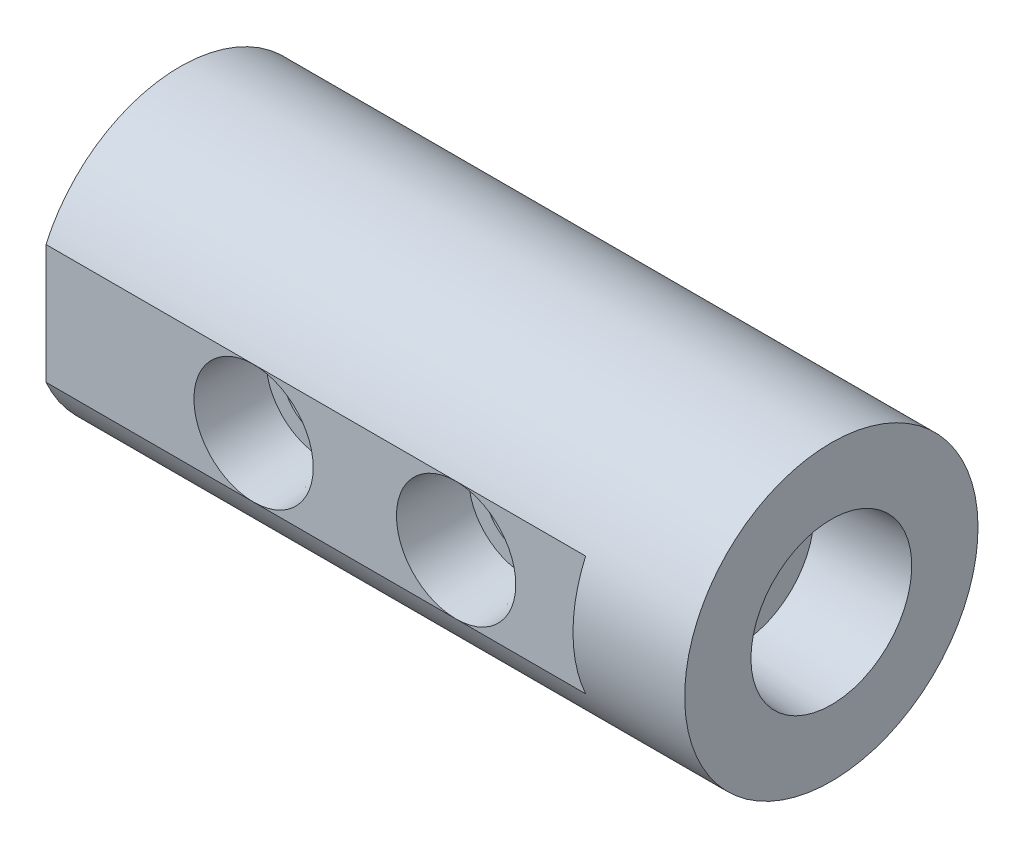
ISO-10303-21;
HEADER;
FILE_DESCRIPTION(('STEP AP214'),'2;1');
FILE_NAME('part.step','',(''),(''),'','','');
FILE_SCHEMA(('AUTOMOTIVE_DESIGN { 1 0 10303 214 1 1 1 1 }'));
ENDSEC;
DATA;
#1=APPLICATION_CONTEXT('core data for automotive mechanical design processes');
#2=APPLICATION_PROTOCOL_DEFINITION('international standard','automotive_design',2000,#1);
#3=PRODUCT_CONTEXT('',#1,'mechanical');
#4=PRODUCT('Part','Part','',(#3));
#5=PRODUCT_RELATED_PRODUCT_CATEGORY('part','',(#4));
#6=PRODUCT_DEFINITION_FORMATION('','',#4);
#7=PRODUCT_DEFINITION_CONTEXT('part definition',#1,'design');
#8=PRODUCT_DEFINITION('design','',#6,#7);
#9=PRODUCT_DEFINITION_SHAPE('','',#8);
#10=(LENGTH_UNIT() NAMED_UNIT(*) SI_UNIT(.MILLI.,.METRE.));
#11=(NAMED_UNIT(*) PLANE_ANGLE_UNIT() SI_UNIT($,.RADIAN.));
#12=(NAMED_UNIT(*) SI_UNIT($,.STERADIAN.) SOLID_ANGLE_UNIT());
#13=UNCERTAINTY_MEASURE_WITH_UNIT(LENGTH_MEASURE(1.E-05),#10,'distance_accuracy_value','');
#14=(GEOMETRIC_REPRESENTATION_CONTEXT(3) GLOBAL_UNCERTAINTY_ASSIGNED_CONTEXT((#13)) GLOBAL_UNIT_ASSIGNED_CONTEXT((#10,
#11,#12)) REPRESENTATION_CONTEXT('',''));
#15=CARTESIAN_POINT('',(0.,0.,0.));
#16=DIRECTION('',(0.,0.,1.));
#17=DIRECTION('',(1.,0.,0.));
#18=AXIS2_PLACEMENT_3D('',#15,#16,#17);
#19=CARTESIAN_POINT('',(34.9758,0.,25.019));
#20=DIRECTION('',(0.,0.,1.));
#21=DIRECTION('',(1.,0.,0.));
#22=AXIS2_PLACEMENT_3D('',#19,#20,#21);
#23=CONICAL_SURFACE('',#22,5.1435,0.0523598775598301);
#24=CARTESIAN_POINT('',(34.9758,0.,23.938041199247));
#25=DIRECTION('',(0.,0.,-1.));
#26=DIRECTION('',(-1.,0.,0.));
#27=AXIS2_PLACEMENT_3D('',#24,#25,#26);
#28=CIRCLE('',#27,5.08684934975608);
#29=CARTESIAN_POINT('',(34.9758,5.08684934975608,23.938041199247));
#30=VERTEX_POINT('',#29);
#31=CARTESIAN_POINT('',(34.9758,-5.08684934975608,23.938041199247));
#32=VERTEX_POINT('',#31);
#33=EDGE_CURVE('E24',#30,#32,#28,.T.);
#34=ORIENTED_EDGE('',*,*,#33,.F.);
#35=EDGE_CURVE('E19',#32,#30,#28,.T.);
#36=ORIENTED_EDGE('',*,*,#35,.F.);
#37=EDGE_LOOP('',(#34,#36));
#38=FACE_BOUND('',#37,.T.);
#39=CARTESIAN_POINT('',(34.9758,0.,18.0848));
#40=DIRECTION('',(0.,0.,-1.));
#41=DIRECTION('',(-1.,0.,0.));
#42=AXIS2_PLACEMENT_3D('',#39,#40,#41);
#43=CIRCLE('',#42,4.78009397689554);
#44=CARTESIAN_POINT('',(30.2683936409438,0.830435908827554,18.0848));
#45=VERTEX_POINT('',#44);
#46=CARTESIAN_POINT('',(30.2683936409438,-0.830435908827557,18.0848));
#47=VERTEX_POINT('',#46);
#48=EDGE_CURVE('E142',#45,#47,#43,.T.);
#49=ORIENTED_EDGE('',*,*,#48,.T.);
#50=CARTESIAN_POINT('',(30.2686411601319,-0.831777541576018,18.0846));
#51=CARTESIAN_POINT('',(30.2502611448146,-0.732341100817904,18.0994554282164));
#52=CARTESIAN_POINT('',(30.2351371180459,-0.631900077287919,18.1117018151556));
#53=CARTESIAN_POINT('',(30.2115526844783,-0.42968409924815,18.1308187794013));
#54=CARTESIAN_POINT('',(30.2030955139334,-0.327908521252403,18.1376867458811));
#55=CARTESIAN_POINT('',(30.1931122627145,-0.125774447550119,18.1457950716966));
#56=CARTESIAN_POINT('',(30.1914550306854,-0.0254267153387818,18.1471419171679));
#57=CARTESIAN_POINT('',(30.1947320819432,0.175036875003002,18.1444794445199));
#58=CARTESIAN_POINT('',(30.1996625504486,0.27515283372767,18.1404732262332));
#59=CARTESIAN_POINT('',(30.2141361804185,0.451419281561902,18.1287268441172));
#60=CARTESIAN_POINT('',(30.2223484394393,0.527756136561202,18.1220648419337));
#61=CARTESIAN_POINT('',(30.2426122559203,0.680180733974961,18.1056489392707));
#62=CARTESIAN_POINT('',(30.2546924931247,0.756262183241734,18.0958719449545));
#63=CARTESIAN_POINT('',(30.2686411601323,0.831777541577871,18.0845999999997));
#64=B_SPLINE_CURVE_WITH_KNOTS('',3,(#50,#51,#52,#53,#54,#55,#56,#57,#58,#59,#60,#61,#62,#63),
.UNSPECIFIED.,.F.,.F.,(4,2,2,2,2,2,4),(0.,0.306549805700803,0.61324832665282,0.91400288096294,
1.21458335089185,1.44563048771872,1.67843205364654),.UNSPECIFIED.);
#65=EDGE_CURVE('E31',#47,#45,#64,.T.);
#66=ORIENTED_EDGE('',*,*,#65,.T.);
#67=EDGE_LOOP('',(#49,#66));
#68=FACE_BOUND('',#67,.T.);
#69=ADVANCED_FACE('F15',(#38,#68),#23,.F.);
#70=CARTESIAN_POINT('',(39.7558939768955,0.,18.0848));
#71=DIRECTION('',(0.,0.,1.));
#72=DIRECTION('',(1.,0.,0.));
#73=AXIS2_PLACEMENT_3D('',#70,#71,#72);
#74=PLANE('',#73);
#75=ORIENTED_EDGE('',*,*,#48,.F.);
#76=DIRECTION('',(-1.,0.,0.));
#77=VECTOR('',#76,1.);
#78=CARTESIAN_POINT('',(23.6347,0.830435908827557,18.0848));
#79=LINE('',#78,#77);
#80=CARTESIAN_POINT('',(31.5595,0.830435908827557,18.0848));
#81=VERTEX_POINT('',#80);
#82=EDGE_CURVE('E134',#45,#81,#79,.F.);
#83=ORIENTED_EDGE('',*,*,#82,.T.);
#84=DIRECTION('',(0.,-1.,0.));
#85=VECTOR('',#84,1.);
#86=CARTESIAN_POINT('',(31.5595,0.,18.0848));
#87=LINE('',#86,#85);
#88=CARTESIAN_POINT('',(31.5595,0.,18.0848));
#89=VERTEX_POINT('',#88);
#90=EDGE_CURVE('E122',#81,#89,#87,.T.);
#91=ORIENTED_EDGE('',*,*,#90,.T.);
#92=CARTESIAN_POINT('',(34.9758,0.,18.0848));
#93=DIRECTION('',(0.,0.,-1.));
#94=DIRECTION('',(-1.,0.,0.));
#95=AXIS2_PLACEMENT_3D('',#92,#93,#94);
#96=CIRCLE('',#95,3.4163);
#97=EDGE_CURVE('E288',#89,#89,#96,.T.);
#98=ORIENTED_EDGE('',*,*,#97,.T.);
#99=CARTESIAN_POINT('',(31.5595,-0.830435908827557,18.0848));
#100=VERTEX_POINT('',#99);
#101=EDGE_CURVE('E127',#89,#100,#87,.T.);
#102=ORIENTED_EDGE('',*,*,#101,.T.);
#103=DIRECTION('',(-1.,0.,0.));
#104=VECTOR('',#103,1.);
#105=CARTESIAN_POINT('',(23.6347,-0.830435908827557,18.0848));
#106=LINE('',#105,#104);
#107=EDGE_CURVE('E135',#100,#47,#106,.T.);
#108=ORIENTED_EDGE('',*,*,#107,.T.);
#109=EDGE_LOOP('',(#75,#83,#91,#98,#102,#108));
#110=FACE_BOUND('',#109,.T.);
#111=ADVANCED_FACE('F140',(#110),#74,.T.);
#112=CARTESIAN_POINT('',(17.7038,0.,18.0848));
#113=DIRECTION('',(0.,0.,-1.));
#114=DIRECTION('',(-1.,0.,0.));
#115=AXIS2_PLACEMENT_3D('',#112,#113,#114);
#116=CYLINDRICAL_SURFACE('',#115,3.4163);
#117=CARTESIAN_POINT('',(17.7038,0.,18.0848));
#118=DIRECTION('',(0.,0.,-1.));
#119=DIRECTION('',(-1.,0.,0.));
#120=AXIS2_PLACEMENT_3D('',#117,#118,#119);
#121=CIRCLE('',#120,3.4163);
#122=CARTESIAN_POINT('',(14.2875,0.,18.0848));
#123=VERTEX_POINT('',#122);
#124=EDGE_CURVE('E291',#123,#123,#121,.T.);
#125=ORIENTED_EDGE('',*,*,#124,.F.);
#126=EDGE_LOOP('',(#125));
#127=FACE_BOUND('',#126,.T.);
#128=CARTESIAN_POINT('',(17.7038,0.,6.36660172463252));
#129=DIRECTION('',(0.,0.,-1.));
#130=DIRECTION('',(-1.,0.,0.));
#131=AXIS2_PLACEMENT_3D('',#128,#129,#130);
#132=CIRCLE('',#131,3.4163);
#133=CARTESIAN_POINT('',(14.2875,0.,6.36660172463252));
#134=VERTEX_POINT('',#133);
#135=EDGE_CURVE('E287',#134,#134,#132,.T.);
#136=ORIENTED_EDGE('',*,*,#135,.T.);
#137=EDGE_LOOP('',(#136));
#138=FACE_BOUND('',#137,.T.);
#139=CARTESIAN_POINT('',(21.1201,0.,15.4305));
#140=CARTESIAN_POINT('',(21.120090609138,-0.13763012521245,15.4304904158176));
#141=CARTESIAN_POINT('',(21.1117070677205,-0.275342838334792,15.4206974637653));
#142=CARTESIAN_POINT('',(21.0789248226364,-0.546180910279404,15.3822512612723));
#143=CARTESIAN_POINT('',(21.0545090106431,-0.679301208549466,15.3535778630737));
#144=CARTESIAN_POINT('',(20.9919180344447,-0.936371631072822,15.2795619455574));
#145=CARTESIAN_POINT('',(20.9538286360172,-1.06037323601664,15.2343232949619));
#146=CARTESIAN_POINT('',(20.8665053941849,-1.29786022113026,15.1295526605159));
#147=CARTESIAN_POINT('',(20.8172681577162,-1.41134238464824,15.070016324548));
#148=CARTESIAN_POINT('',(20.6901091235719,-1.66748912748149,14.9140660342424));
#149=CARTESIAN_POINT('',(20.6083827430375,-1.80495022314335,14.8122219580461));
#150=CARTESIAN_POINT('',(20.4354382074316,-2.05735949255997,14.589873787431));
#151=CARTESIAN_POINT('',(20.3441947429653,-2.17224516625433,14.4693194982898));
#152=CARTESIAN_POINT('',(20.2045919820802,-2.32855611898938,14.2750435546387));
#153=CARTESIAN_POINT('',(20.1571082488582,-2.37840870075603,14.2072902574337));
#154=CARTESIAN_POINT('',(20.0625230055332,-2.47223846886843,14.0675024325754));
#155=CARTESIAN_POINT('',(20.015421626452,-2.51621371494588,13.995466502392));
#156=CARTESIAN_POINT('',(19.9230083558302,-2.59808022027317,13.8471768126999));
#157=CARTESIAN_POINT('',(19.8776928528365,-2.63598428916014,13.7709324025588));
#158=CARTESIAN_POINT('',(19.7904669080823,-2.70555605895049,13.6138466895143));
#159=CARTESIAN_POINT('',(19.748553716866,-2.73722882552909,13.5330091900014));
#160=CARTESIAN_POINT('',(19.668091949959,-2.79558088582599,13.3613595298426));
#161=CARTESIAN_POINT('',(19.6298901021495,-2.8218528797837,13.2702401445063));
#162=CARTESIAN_POINT('',(19.5637571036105,-2.86587683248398,13.0824370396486));
#163=CARTESIAN_POINT('',(19.5358044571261,-2.88364664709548,12.9857654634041));
#164=CARTESIAN_POINT('',(19.4943231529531,-2.90960094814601,12.7863926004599));
#165=CARTESIAN_POINT('',(19.4810131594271,-2.91764029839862,12.683623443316));
#166=CARTESIAN_POINT('',(19.4727884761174,-2.92264023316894,12.4771064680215));
#167=CARTESIAN_POINT('',(19.4778564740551,-2.91961124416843,12.3733596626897));
#168=CARTESIAN_POINT('',(19.5029412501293,-2.90419341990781,12.1846802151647));
#169=CARTESIAN_POINT('',(19.5205797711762,-2.8932903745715,12.0992763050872));
#170=CARTESIAN_POINT('',(19.5654359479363,-2.86463291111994,11.9321592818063));
#171=CARTESIAN_POINT('',(19.5926699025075,-2.84686683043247,11.8504527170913));
#172=CARTESIAN_POINT('',(19.6512793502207,-2.80705729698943,11.6981209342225));
#173=CARTESIAN_POINT('',(19.6821021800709,-2.78550899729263,11.6271453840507));
#174=CARTESIAN_POINT('',(19.7476585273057,-2.73777318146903,11.4886158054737));
#175=CARTESIAN_POINT('',(19.7823950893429,-2.71158204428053,11.4210645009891));
#176=CARTESIAN_POINT('',(19.8904787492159,-2.62638732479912,11.2230068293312));
#177=CARTESIAN_POINT('',(19.9675929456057,-2.56083025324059,11.097346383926));
#178=CARTESIAN_POINT('',(20.1304457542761,-2.40749854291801,10.8484151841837));
#179=CARTESIAN_POINT('',(20.2163843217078,-2.3183775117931,10.7261181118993));
#180=CARTESIAN_POINT('',(20.384985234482,-2.1211247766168,10.4955428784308));
#181=CARTESIAN_POINT('',(20.4676513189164,-2.0130155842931,10.3872483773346));
#182=CARTESIAN_POINT('',(20.6198388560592,-1.7847920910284,10.1926400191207));
#183=CARTESIAN_POINT('',(20.6898552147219,-1.66581804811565,10.1053863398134));
#184=CARTESIAN_POINT('',(20.8181703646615,-1.41139345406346,9.94775688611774));
#185=CARTESIAN_POINT('',(20.8764804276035,-1.27595895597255,9.87736486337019));
#186=CARTESIAN_POINT('',(20.9681111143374,-1.01538344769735,9.767675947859));
#187=CARTESIAN_POINT('',(21.0040130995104,-0.892540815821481,9.72510166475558));
#188=CARTESIAN_POINT('',(21.0622633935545,-0.639271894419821,9.65630009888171));
#189=CARTESIAN_POINT('',(21.084621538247,-0.5088511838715,9.63006095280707));
#190=CARTESIAN_POINT('',(21.1140505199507,-0.243321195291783,9.59556343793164));
#191=CARTESIAN_POINT('',(21.1210540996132,-0.108193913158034,9.587384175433));
#192=CARTESIAN_POINT('',(21.1189358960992,0.16176355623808,9.58986143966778));
#193=CARTESIAN_POINT('',(21.1098143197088,0.296593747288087,9.6005177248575));
#194=CARTESIAN_POINT('',(21.0774538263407,0.552290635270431,9.63847860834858));
#195=CARTESIAN_POINT('',(21.0552444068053,0.673475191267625,9.66456962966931));
#196=CARTESIAN_POINT('',(20.9991651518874,0.909037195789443,9.73085334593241));
#197=CARTESIAN_POINT('',(20.9652935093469,1.02341358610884,9.77104822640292));
#198=CARTESIAN_POINT('',(20.8846056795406,1.25283364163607,9.86763898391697));
#199=CARTESIAN_POINT('',(20.8369374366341,1.36711677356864,9.92511696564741));
#200=CARTESIAN_POINT('',(20.7329148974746,1.58433524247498,10.0522667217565));
#201=CARTESIAN_POINT('',(20.676553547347,1.68726124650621,10.1219484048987));
#202=CARTESIAN_POINT('',(20.5277835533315,1.93012400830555,10.3093186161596));
#203=CARTESIAN_POINT('',(20.4314806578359,2.06270819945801,10.433548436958));
#204=CARTESIAN_POINT('',(20.2830534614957,2.24156498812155,10.6344802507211));
#205=CARTESIAN_POINT('',(20.2328350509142,2.29791871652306,10.7040072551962));
#206=CARTESIAN_POINT('',(20.1322492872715,2.4039715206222,10.8478336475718));
#207=CARTESIAN_POINT('',(20.0818819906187,2.45367285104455,10.9221314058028));
#208=CARTESIAN_POINT('',(19.9569856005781,2.56996413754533,11.1145643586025));
#209=CARTESIAN_POINT('',(19.8831669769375,2.63232397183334,11.2358110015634));
#210=CARTESIAN_POINT('',(19.7796017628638,2.71368799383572,11.4265039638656));
#211=CARTESIAN_POINT('',(19.7463005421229,2.73876295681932,11.491476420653));
#212=CARTESIAN_POINT('',(19.6833147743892,2.78462509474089,11.6245920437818));
#213=CARTESIAN_POINT('',(19.6536281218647,2.80541477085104,11.6927333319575));
#214=CARTESIAN_POINT('',(19.5926033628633,2.84696514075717,11.849821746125));
#215=CARTESIAN_POINT('',(19.5627129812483,2.86641514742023,11.9397062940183));
#216=CARTESIAN_POINT('',(19.5148051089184,2.89692797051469,12.1238669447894));
#217=CARTESIAN_POINT('',(19.496757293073,2.90801222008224,12.2181311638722));
#218=CARTESIAN_POINT('',(19.47570452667,2.92089706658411,12.409997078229));
#219=CARTESIAN_POINT('',(19.4728457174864,2.92260747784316,12.5076221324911));
#220=CARTESIAN_POINT('',(19.4832312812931,2.9162908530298,12.7017205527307));
#221=CARTESIAN_POINT('',(19.496492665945,2.90825353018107,12.7981925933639));
#222=CARTESIAN_POINT('',(19.5404084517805,2.88075399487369,13.0061349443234));
#223=CARTESIAN_POINT('',(19.574045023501,2.85930518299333,13.1166786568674));
#224=CARTESIAN_POINT('',(19.6538871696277,2.80545293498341,13.3304249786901));
#225=CARTESIAN_POINT('',(19.7001371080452,2.77301073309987,13.4336000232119));
#226=CARTESIAN_POINT('',(19.7913813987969,2.70477474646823,13.6159549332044));
#227=CARTESIAN_POINT('',(19.8352862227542,2.67045479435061,13.6962576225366));
#228=CARTESIAN_POINT('',(19.9259203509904,2.5955239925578,13.8522544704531));
#229=CARTESIAN_POINT('',(19.9726513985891,2.55490923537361,13.927945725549));
#230=CARTESIAN_POINT('',(20.0673794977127,2.46754103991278,14.0750042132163));
#231=CARTESIAN_POINT('',(20.1153779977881,2.42078031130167,14.146366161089));
#232=CARTESIAN_POINT('',(20.2113659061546,2.32120724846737,14.2847472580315));
#233=CARTESIAN_POINT('',(20.2593553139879,2.26839466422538,14.3517662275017));
#234=CARTESIAN_POINT('',(20.3564206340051,2.15419924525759,14.4842537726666));
#235=CARTESIAN_POINT('',(20.4054489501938,2.09253851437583,14.5495184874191));
#236=CARTESIAN_POINT('',(20.501306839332,1.96254574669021,14.6748656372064));
#237=CARTESIAN_POINT('',(20.548135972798,1.89421238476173,14.7349470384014));
#238=CARTESIAN_POINT('',(20.638420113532,1.7510707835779,14.8492336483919));
#239=CARTESIAN_POINT('',(20.6818836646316,1.67628003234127,14.9034538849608));
#240=CARTESIAN_POINT('',(20.7644917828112,1.52022021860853,15.0054694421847));
#241=CARTESIAN_POINT('',(20.8036369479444,1.43895205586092,15.0532656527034));
#242=CARTESIAN_POINT('',(20.8899410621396,1.23911359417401,15.1578579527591));
#243=CARTESIAN_POINT('',(20.9347501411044,1.11781933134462,15.2114960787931));
#244=CARTESIAN_POINT('',(21.0112640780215,0.865501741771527,15.3025382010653));
#245=CARTESIAN_POINT('',(21.042991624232,0.734495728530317,15.3399703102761));
#246=CARTESIAN_POINT('',(21.084390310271,0.502566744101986,15.3886732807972));
#247=CARTESIAN_POINT('',(21.0977180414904,0.403193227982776,15.4042961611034));
#248=CARTESIAN_POINT('',(21.1155769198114,0.202561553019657,15.4252137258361));
#249=CARTESIAN_POINT('',(21.1201069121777,0.101303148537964,15.4305070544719));
#250=CARTESIAN_POINT('',(21.1201,0.,15.4305));
#251=B_SPLINE_CURVE_WITH_KNOTS('',3,(#139,#140,#141,#142,#143,#144,#145,#146,#147,#148,#149,
#150,#151,#152,#153,#154,#155,#156,#157,#158,#159,#160,#161,#162,#163,#164,#165,#166,#167,#168,
#169,#170,#171,#172,#173,#174,#175,#176,#177,#178,#179,#180,#181,#182,#183,#184,#185,#186,#187,
#188,#189,#190,#191,#192,#193,#194,#195,#196,#197,#198,#199,#200,#201,#202,#203,#204,#205,#206,
#207,#208,#209,#210,#211,#212,#213,#214,#215,#216,#217,#218,#219,#220,#221,#222,#223,#224,#225,
#226,#227,#228,#229,#230,#231,#232,#233,#234,#235,#236,#237,#238,#239,#240,#241,#242,#243,#244,
#245,#246,#247,#248,#249,#250),.UNSPECIFIED.,.T.,.F.,(4,2,2,2,2,2,2,2,2,2,2,2,2,2,2,2,2,2,2,2,2,
2,2,2,2,2,2,2,2,2,2,2,2,2,2,2,2,2,2,2,2,2,2,2,2,2,2,2,2,2,2,2,2,2,2,4),(0.,0.412458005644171,
0.825356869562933,1.23570987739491,1.6461879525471,2.21196913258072,2.77929526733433,
3.06886037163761,3.35852083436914,3.64756185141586,3.93636691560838,4.24229184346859,
4.54757143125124,4.85735046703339,5.16683776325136,5.42949040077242,5.69259134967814,
5.93321287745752,6.17402290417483,6.65647364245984,7.17705207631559,7.69701744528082,
8.18514797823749,8.67280622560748,9.07575731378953,9.47841541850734,9.88283378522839,
10.2872469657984,10.663440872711,11.0396931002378,11.4477435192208,11.8561268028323,
12.4694827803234,12.7771111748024,13.0846350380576,13.5482291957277,13.7796106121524,
14.010856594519,14.3000046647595,14.58840939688,14.8795840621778,15.1710662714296,
15.5216678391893,15.8735188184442,16.1663794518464,16.459422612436,16.7528165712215,
17.0462226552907,17.3527691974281,17.6593767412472,17.9651785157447,18.2709378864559,
18.6891835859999,19.1067008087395,19.4102521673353,19.713843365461),.UNSPECIFIED.);
#252=CARTESIAN_POINT('',(21.1201,0.,15.4305));
#253=VERTEX_POINT('',#252);
#254=EDGE_CURVE('E211',#253,#253,#251,.T.);
#255=ORIENTED_EDGE('',*,*,#254,.T.);
#256=EDGE_LOOP('',(#255));
#257=FACE_BOUND('',#256,.T.);
#258=ADVANCED_FACE('F220',(#127,#138,#257),#116,.F.);
#259=CARTESIAN_POINT('',(34.9758,0.,18.0848));
#260=DIRECTION('',(0.,0.,-1.));
#261=DIRECTION('',(-1.,0.,0.));
#262=AXIS2_PLACEMENT_3D('',#259,#260,#261);
#263=CYLINDRICAL_SURFACE('',#262,3.4163);
#264=CARTESIAN_POINT('',(31.5595,0.,16.4719));
#265=CARTESIAN_POINT('',(31.559497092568,0.0803063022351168,16.4719028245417));
#266=CARTESIAN_POINT('',(31.5623347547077,0.160589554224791,16.4694552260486));
#267=CARTESIAN_POINT('',(31.5736227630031,0.320492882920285,16.4597290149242));
#268=CARTESIAN_POINT('',(31.582074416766,0.400112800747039,16.4524492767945));
#269=CARTESIAN_POINT('',(31.604444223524,0.558060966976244,16.4332119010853));
#270=CARTESIAN_POINT('',(31.618366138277,0.636388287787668,16.4212510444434));
#271=CARTESIAN_POINT('',(31.6514223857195,0.79113340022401,16.3929164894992));
#272=CARTESIAN_POINT('',(31.6705590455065,0.867550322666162,16.3765408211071));
#273=CARTESIAN_POINT('',(31.7350557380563,1.09214125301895,16.3215099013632));
#274=CARTESIAN_POINT('',(31.7876769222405,1.23684061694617,16.2767990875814));
#275=CARTESIAN_POINT('',(31.9094782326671,1.51385792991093,16.1743010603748));
#276=CARTESIAN_POINT('',(31.978663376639,1.64617211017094,16.116509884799));
#277=CARTESIAN_POINT('',(32.1601360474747,1.94533174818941,15.966934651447));
#278=CARTESIAN_POINT('',(32.2787960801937,2.10608199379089,15.8705951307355));
#279=CARTESIAN_POINT('',(32.4727699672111,2.32714973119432,15.7177858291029));
#280=CARTESIAN_POINT('',(32.5402275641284,2.39760447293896,15.6653643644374));
#281=CARTESIAN_POINT('',(32.6801239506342,2.53186918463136,15.5586936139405));
#282=CARTESIAN_POINT('',(32.7525609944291,2.59568146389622,15.5044449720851));
#283=CARTESIAN_POINT('',(32.9037180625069,2.71794677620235,15.393994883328));
#284=CARTESIAN_POINT('',(32.982537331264,2.77626097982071,15.3377762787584));
#285=CARTESIAN_POINT('',(33.1450863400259,2.8860378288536,15.2256648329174));
#286=CARTESIAN_POINT('',(33.2288176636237,2.93749824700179,15.16977210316));
#287=CARTESIAN_POINT('',(33.401150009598,3.03336278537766,15.0599162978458));
#288=CARTESIAN_POINT('',(33.4897406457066,3.07778122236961,15.0059494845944));
#289=CARTESIAN_POINT('',(33.672250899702,3.159406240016,14.9018077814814));
#290=CARTESIAN_POINT('',(33.7661662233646,3.19661852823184,14.8516299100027));
#291=CARTESIAN_POINT('',(33.9645415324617,3.26496690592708,14.7554389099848));
#292=CARTESIAN_POINT('',(34.0692918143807,3.29572215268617,14.7097445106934));
#293=CARTESIAN_POINT('',(34.2854208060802,3.34764850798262,14.6299129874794));
#294=CARTESIAN_POINT('',(34.3967863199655,3.36883801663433,14.5957537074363));
#295=CARTESIAN_POINT('',(34.5687542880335,3.39247015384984,14.5569357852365));
#296=CARTESIAN_POINT('',(34.6274071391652,3.39900818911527,14.5460292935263));
#297=CARTESIAN_POINT('',(34.745662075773,3.40905503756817,14.5291672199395));
#298=CARTESIAN_POINT('',(34.8052635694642,3.4125656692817,14.5232086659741));
#299=CARTESIAN_POINT('',(34.9248168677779,3.41644244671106,14.5166249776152));
#300=CARTESIAN_POINT('',(34.9847683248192,3.41681130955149,14.5159952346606));
#301=CARTESIAN_POINT('',(35.1044098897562,3.4144034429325,14.5200882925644));
#302=CARTESIAN_POINT('',(35.1641000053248,3.4116268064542,14.524810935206));
#303=CARTESIAN_POINT('',(35.3230241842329,3.40007288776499,14.544281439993));
#304=CARTESIAN_POINT('',(35.4215104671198,3.3884971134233,14.5636658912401));
#305=CARTESIAN_POINT('',(35.6142426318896,3.35754135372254,14.6138699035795));
#306=CARTESIAN_POINT('',(35.708480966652,3.33814804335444,14.6447089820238));
#307=CARTESIAN_POINT('',(35.8835396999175,3.29461308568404,14.7112196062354));
#308=CARTESIAN_POINT('',(35.9647931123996,3.27108033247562,14.7461755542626));
#309=CARTESIAN_POINT('',(36.1234615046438,3.21884492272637,14.8207168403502));
#310=CARTESIAN_POINT('',(36.2008734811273,3.19013829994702,14.8603057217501));
#311=CARTESIAN_POINT('',(36.3522740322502,3.12780229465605,14.9426342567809));
#312=CARTESIAN_POINT('',(36.4262512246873,3.09415789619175,14.9853833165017));
#313=CARTESIAN_POINT('',(36.5707741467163,3.02219780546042,15.0727285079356));
#314=CARTESIAN_POINT('',(36.6413189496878,2.98388086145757,15.117325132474));
#315=CARTESIAN_POINT('',(36.8037008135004,2.88819350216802,15.2234848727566));
#316=CARTESIAN_POINT('',(36.894162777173,2.82890033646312,15.285428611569));
#317=CARTESIAN_POINT('',(37.0691883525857,2.70194730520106,15.4091488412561));
#318=CARTESIAN_POINT('',(37.1537497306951,2.63428429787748,15.4709252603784));
#319=CARTESIAN_POINT('',(37.3165890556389,2.49069595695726,15.5926617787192));
#320=CARTESIAN_POINT('',(37.3948795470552,2.41478787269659,15.6526253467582));
#321=CARTESIAN_POINT('',(37.544867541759,2.25456019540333,15.7694710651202));
#322=CARTESIAN_POINT('',(37.6165651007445,2.17024067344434,15.8263532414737));
#323=CARTESIAN_POINT('',(37.7844850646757,1.95172927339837,15.9612634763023));
#324=CARTESIAN_POINT('',(37.8765140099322,1.81264304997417,16.0367536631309));
#325=CARTESIAN_POINT('',(38.0413597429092,1.51722188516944,16.1735226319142));
#326=CARTESIAN_POINT('',(38.1142031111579,1.36091123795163,16.2348210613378));
#327=CARTESIAN_POINT('',(38.2272232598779,1.05885599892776,16.3305612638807));
#328=CARTESIAN_POINT('',(38.2707094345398,0.915214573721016,16.3676901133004));
#329=CARTESIAN_POINT('',(38.3387026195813,0.620350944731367,16.4259155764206));
#330=CARTESIAN_POINT('',(38.3632201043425,0.469132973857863,16.4470210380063));
#331=CARTESIAN_POINT('',(38.3916940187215,0.162800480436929,16.4715432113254));
#332=CARTESIAN_POINT('',(38.3955814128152,0.00767461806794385,16.4749005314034));
#333=CARTESIAN_POINT('',(38.3823197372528,-0.300992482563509,16.4634693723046));
#334=CARTESIAN_POINT('',(38.3651692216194,-0.454533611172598,16.4486796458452));
#335=CARTESIAN_POINT('',(38.3124756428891,-0.747466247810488,16.403436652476));
#336=CARTESIAN_POINT('',(38.2779408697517,-0.887177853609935,16.3738425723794));
#337=CARTESIAN_POINT('',(38.1929808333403,-1.15802807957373,16.3015004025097));
#338=CARTESIAN_POINT('',(38.1425509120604,-1.28916417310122,16.2587484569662));
#339=CARTESIAN_POINT('',(38.0074461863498,-1.58602906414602,16.1452381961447));
#340=CARTESIAN_POINT('',(37.9169737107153,-1.74737736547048,16.0699310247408));
#341=CARTESIAN_POINT('',(37.7154693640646,-2.04899529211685,15.9053618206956));
#342=CARTESIAN_POINT('',(37.6043874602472,-2.18921208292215,15.8160659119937));
#343=CARTESIAN_POINT('',(37.4100145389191,-2.39955591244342,15.6642960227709));
#344=CARTESIAN_POINT('',(37.3318289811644,-2.4763077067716,15.6042532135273));
#345=CARTESIAN_POINT('',(37.1692805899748,-2.62137661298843,15.4823714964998));
#346=CARTESIAN_POINT('',(37.0849185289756,-2.68969477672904,15.4205328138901));
#347=CARTESIAN_POINT('',(36.9102571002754,-2.81792892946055,15.2965840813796));
#348=CARTESIAN_POINT('',(36.8199586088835,-2.8778461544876,15.2344740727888));
#349=CARTESIAN_POINT('',(36.6333606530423,-2.9892131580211,15.1118207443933));
#350=CARTESIAN_POINT('',(36.5370647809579,-3.04066793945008,15.0512765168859));
#351=CARTESIAN_POINT('',(36.3243334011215,-3.1413812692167,14.9260320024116));
#352=CARTESIAN_POINT('',(36.2069480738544,-3.18936815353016,14.8619025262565));
#353=CARTESIAN_POINT('',(35.9630064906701,-3.2730869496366,14.7439405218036));
#354=CARTESIAN_POINT('',(35.8364692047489,-3.30884337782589,14.690087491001));
#355=CARTESIAN_POINT('',(35.6053725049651,-3.35933894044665,14.6111950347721));
#356=CARTESIAN_POINT('',(35.5028127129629,-3.37706123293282,14.5823433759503));
#357=CARTESIAN_POINT('',(35.2935797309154,-3.40311197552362,14.5393028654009));
#358=CARTESIAN_POINT('',(35.1869171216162,-3.41146310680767,14.5250786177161));
#359=CARTESIAN_POINT('',(34.9716747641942,-3.41800080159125,14.5139808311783));
#360=CARTESIAN_POINT('',(34.8630873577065,-3.41612615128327,14.517211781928));
#361=CARTESIAN_POINT('',(34.6483502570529,-3.40228128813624,14.5405720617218));
#362=CARTESIAN_POINT('',(34.5422052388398,-3.39029313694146,14.5607314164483));
#363=CARTESIAN_POINT('',(34.2999449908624,-3.35172562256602,14.6233288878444));
#364=CARTESIAN_POINT('',(34.165804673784,-3.32158736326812,14.6709896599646));
#365=CARTESIAN_POINT('',(33.9072742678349,-3.24770348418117,14.7804896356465));
#366=CARTESIAN_POINT('',(33.7829235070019,-3.20390616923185,14.8423824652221));
#367=CARTESIAN_POINT('',(33.5637618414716,-3.11268634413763,14.9623563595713));
#368=CARTESIAN_POINT('',(33.4675197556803,-3.06714128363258,15.0193009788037));
#369=CARTESIAN_POINT('',(33.2808069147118,-2.9680441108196,15.135747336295));
#370=CARTESIAN_POINT('',(33.1903397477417,-2.91448708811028,15.1952506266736));
#371=CARTESIAN_POINT('',(33.0149860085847,-2.79951781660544,15.3148879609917));
#372=CARTESIAN_POINT('',(32.9300994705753,-2.73810551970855,15.3750220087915));
#373=CARTESIAN_POINT('',(32.7659937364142,-2.60746130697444,15.4943942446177));
#374=CARTESIAN_POINT('',(32.6867725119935,-2.5382322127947,15.5536327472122));
#375=CARTESIAN_POINT('',(32.4791534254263,-2.33901966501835,15.7119184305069));
#376=CARTESIAN_POINT('',(32.3564779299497,-2.20121820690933,15.8088756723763));
#377=CARTESIAN_POINT('',(32.1319737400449,-1.90224783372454,15.989801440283));
#378=CARTESIAN_POINT('',(32.0301070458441,-1.74112244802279,16.073793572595));
#379=CARTESIAN_POINT('',(31.8711699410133,-1.4337349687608,16.2063580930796));
#380=CARTESIAN_POINT('',(31.8091788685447,-1.29164271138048,16.2586640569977));
#381=CARTESIAN_POINT('',(31.7041904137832,-0.996065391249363,16.3477496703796));
#382=CARTESIAN_POINT('',(31.6611619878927,-0.842599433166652,16.3845546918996));
#383=CARTESIAN_POINT('',(31.6060948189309,-0.573772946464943,16.4317812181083));
#384=CARTESIAN_POINT('',(31.5886865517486,-0.460278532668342,16.4467596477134));
#385=CARTESIAN_POINT('',(31.5653906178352,-0.231173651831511,16.4668175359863));
#386=CARTESIAN_POINT('',(31.559504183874,-0.115562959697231,16.4718959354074));
#387=CARTESIAN_POINT('',(31.5595,0.,16.4719));
#388=B_SPLINE_CURVE_WITH_KNOTS('',3,(#264,#265,#266,#267,#268,#269,#270,#271,#272,#273,#274,
#275,#276,#277,#278,#279,#280,#281,#282,#283,#284,#285,#286,#287,#288,#289,#290,#291,#292,#293,
#294,#295,#296,#297,#298,#299,#300,#301,#302,#303,#304,#305,#306,#307,#308,#309,#310,#311,#312,
#313,#314,#315,#316,#317,#318,#319,#320,#321,#322,#323,#324,#325,#326,#327,#328,#329,#330,#331,
#332,#333,#334,#335,#336,#337,#338,#339,#340,#341,#342,#343,#344,#345,#346,#347,#348,#349,#350,
#351,#352,#353,#354,#355,#356,#357,#358,#359,#360,#361,#362,#363,#364,#365,#366,#367,#368,#369,
#370,#371,#372,#373,#374,#375,#376,#377,#378,#379,#380,#381,#382,#383,#384,#385,#386,#387),
.UNSPECIFIED.,.T.,.F.,(4,2,2,2,2,2,2,2,2,2,2,2,2,2,2,2,2,2,2,2,2,2,2,2,2,2,2,2,2,2,2,2,2,2,2,2,
2,2,2,2,2,2,2,2,2,2,2,2,2,2,2,2,2,2,2,2,2,2,2,2,2,4),(0.,0.240792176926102,0.481640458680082,
0.722654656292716,0.96377658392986,1.44244573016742,1.92126006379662,2.58282558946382,
2.91480342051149,3.24666544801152,3.5854198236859,3.92428401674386,4.26245019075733,
4.60034741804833,4.9545842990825,5.30813685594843,5.48793742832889,5.66762992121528,
5.84716699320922,6.02669875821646,6.32847127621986,6.63076035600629,6.9049522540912,
7.17935524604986,7.45461069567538,7.72994004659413,8.10342515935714,8.47705089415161,
8.84990950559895,9.22276496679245,9.76983274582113,10.3161385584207,10.7779757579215,
11.239557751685,11.7026833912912,12.1658408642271,12.6047878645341,13.0438636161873,
13.6398152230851,14.2372329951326,14.6116324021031,14.9859850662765,15.3602825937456,
15.734358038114,16.1597970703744,16.5843782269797,16.907216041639,17.2292707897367,
17.5532555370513,17.8778161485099,18.3119103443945,18.7476678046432,19.1094542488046,
19.4714633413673,19.8334746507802,20.1953556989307,20.8181323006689,21.4397612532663,
21.928687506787,22.4168103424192,22.7632797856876,23.1097862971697),.UNSPECIFIED.);
#389=CARTESIAN_POINT('',(31.5595,0.,16.4719));
#390=VERTEX_POINT('',#389);
#391=EDGE_CURVE('E183',#390,#390,#388,.T.);
#392=ORIENTED_EDGE('',*,*,#391,.T.);
#393=EDGE_LOOP('',(#392));
#394=FACE_BOUND('',#393,.T.);
#395=ORIENTED_EDGE('',*,*,#97,.F.);
#396=EDGE_LOOP('',(#395));
#397=FACE_BOUND('',#396,.T.);
#398=ADVANCED_FACE('F188',(#394,#397),#263,.F.);
#399=CARTESIAN_POINT('',(47.625,0.,6.06682116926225));
#400=DIRECTION('',(1.,0.,0.));
#401=DIRECTION('',(0.,0.,-1.));
#402=AXIS2_PLACEMENT_3D('',#399,#400,#401);
#403=PLANE('',#402);
#404=CARTESIAN_POINT('',(47.625,0.,12.5095));
#405=DIRECTION('',(-1.,0.,0.));
#406=DIRECTION('',(0.,0.,1.));
#407=AXIS2_PLACEMENT_3D('',#404,#405,#406);
#408=CIRCLE('',#407,6.44267883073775);
#409=CARTESIAN_POINT('',(47.625,0.,18.9521788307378));
#410=VERTEX_POINT('',#409);
#411=EDGE_CURVE('E436',#410,#410,#408,.T.);
#412=ORIENTED_EDGE('',*,*,#411,.F.);
#413=EDGE_LOOP('',(#412));
#414=FACE_BOUND('',#413,.T.);
#415=CARTESIAN_POINT('',(47.625,0.,12.5095));
#416=DIRECTION('',(1.,0.,0.));
#417=DIRECTION('',(0.,0.,-1.));
#418=AXIS2_PLACEMENT_3D('',#415,#416,#417);
#419=CIRCLE('',#418,3.9624);
#420=CARTESIAN_POINT('',(47.625,0.,8.5471));
#421=VERTEX_POINT('',#420);
#422=EDGE_CURVE('E218',#421,#421,#419,.F.);
#423=ORIENTED_EDGE('',*,*,#422,.T.);
#424=EDGE_LOOP('',(#423));
#425=FACE_BOUND('',#424,.T.);
#426=ADVANCED_FACE('F208',(#414,#425),#403,.T.);
#427=CARTESIAN_POINT('',(55.5498,0.,12.5095));
#428=DIRECTION('',(-1.,0.,0.));
#429=DIRECTION('',(0.,-1.,0.));
#430=AXIS2_PLACEMENT_3D('',#427,#428,#429);
#431=PLANE('',#430);
#432=CARTESIAN_POINT('',(55.5498,0.,12.5095));
#433=DIRECTION('',(-1.,0.,0.));
#434=DIRECTION('',(0.,1.,0.));
#435=AXIS2_PLACEMENT_3D('',#432,#433,#434);
#436=CIRCLE('',#435,12.5095);
#437=CARTESIAN_POINT('',(55.5498,12.5095,12.5095));
#438=VERTEX_POINT('',#437);
#439=EDGE_CURVE('E356',#438,#438,#436,.T.);
#440=ORIENTED_EDGE('',*,*,#439,.F.);
#441=EDGE_LOOP('',(#440));
#442=FACE_BOUND('',#441,.T.);
#443=CARTESIAN_POINT('',(55.5498,0.,12.5095));
#444=DIRECTION('',(-1.,0.,0.));
#445=DIRECTION('',(0.,0.,1.));
#446=AXIS2_PLACEMENT_3D('',#443,#444,#445);
#447=CIRCLE('',#446,6.858);
#448=CARTESIAN_POINT('',(55.5498,0.,19.3675));
#449=VERTEX_POINT('',#448);
#450=EDGE_CURVE('E434',#449,#449,#447,.T.);
#451=ORIENTED_EDGE('',*,*,#450,.T.);
#452=EDGE_LOOP('',(#451));
#453=FACE_BOUND('',#452,.T.);
#454=ADVANCED_FACE('F266',(#442,#453),#431,.F.);
#455=CARTESIAN_POINT('',(55.5498,0.,12.5095));
#456=DIRECTION('',(-1.,0.,0.));
#457=DIRECTION('',(0.,0.,1.));
#458=AXIS2_PLACEMENT_3D('',#455,#456,#457);
#459=CYLINDRICAL_SURFACE('',#458,12.5095);
#460=DIRECTION('',(-1.,0.,0.));
#461=VECTOR('',#460,1.);
#462=CARTESIAN_POINT('',(46.0248,5.08684934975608,23.938041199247));
#463=LINE('',#462,#461);
#464=CARTESIAN_POINT('',(17.7038,5.08684934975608,23.938041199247));
#465=VERTEX_POINT('',#464);
#466=EDGE_CURVE('E168',#30,#465,#463,.T.);
#467=ORIENTED_EDGE('',*,*,#466,.F.);
#468=CARTESIAN_POINT('',(46.0248,5.08684934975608,23.938041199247));
#469=VERTEX_POINT('',#468);
#470=EDGE_CURVE('E164',#469,#30,#463,.T.);
#471=ORIENTED_EDGE('',*,*,#470,.F.);
#472=CARTESIAN_POINT('',(46.0248,0.,12.5095));
#473=DIRECTION('',(-1.,0.,0.));
#474=DIRECTION('',(0.,-1.,0.));
#475=AXIS2_PLACEMENT_3D('',#472,#473,#474);
#476=CIRCLE('',#475,12.5095);
#477=CARTESIAN_POINT('',(46.0248,-5.08684934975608,23.938041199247));
#478=VERTEX_POINT('',#477);
#479=EDGE_CURVE('E10',#469,#478,#476,.F.);
#480=ORIENTED_EDGE('',*,*,#479,.T.);
#481=DIRECTION('',(-1.,0.,0.));
#482=VECTOR('',#481,1.);
#483=CARTESIAN_POINT('',(46.0248,-5.08684934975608,23.938041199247));
#484=LINE('',#483,#482);
#485=EDGE_CURVE('E159',#478,#32,#484,.T.);
#486=ORIENTED_EDGE('',*,*,#485,.T.);
#487=CARTESIAN_POINT('',(17.7038,-5.08684934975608,23.938041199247));
#488=VERTEX_POINT('',#487);
#489=EDGE_CURVE('E163',#32,#488,#484,.T.);
#490=ORIENTED_EDGE('',*,*,#489,.T.);
#491=CARTESIAN_POINT('',(0.,-5.08684934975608,23.938041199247));
#492=VERTEX_POINT('',#491);
#493=EDGE_CURVE('E158',#488,#492,#484,.T.);
#494=ORIENTED_EDGE('',*,*,#493,.T.);
#495=CARTESIAN_POINT('',(0.,0.,12.5095));
#496=DIRECTION('',(-1.,0.,0.));
#497=DIRECTION('',(0.,1.,0.));
#498=AXIS2_PLACEMENT_3D('',#495,#496,#497);
#499=CIRCLE('',#498,12.5095);
#500=CARTESIAN_POINT('',(0.,5.08684934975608,23.938041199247));
#501=VERTEX_POINT('',#500);
#502=EDGE_CURVE('E353',#501,#492,#499,.T.);
#503=ORIENTED_EDGE('',*,*,#502,.F.);
#504=EDGE_CURVE('E162',#465,#501,#463,.T.);
#505=ORIENTED_EDGE('',*,*,#504,.F.);
#506=EDGE_LOOP('',(#467,#471,#480,#486,#490,#494,#503,#505));
#507=FACE_BOUND('',#506,.T.);
#508=ORIENTED_EDGE('',*,*,#439,.T.);
#509=EDGE_LOOP('',(#508));
#510=FACE_BOUND('',#509,.T.);
#511=ADVANCED_FACE('F17',(#507,#510),#459,.T.);
#512=CARTESIAN_POINT('',(0.,0.,12.5095));
#513=DIRECTION('',(-1.,0.,0.));
#514=DIRECTION('',(0.,-1.,0.));
#515=AXIS2_PLACEMENT_3D('',#512,#513,#514);
#516=PLANE('',#515);
#517=DIRECTION('',(0.,-1.,0.));
#518=VECTOR('',#517,1.);
#519=CARTESIAN_POINT('',(0.,5.08684934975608,23.938041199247));
#520=LINE('',#519,#518);
#521=EDGE_CURVE('E131',#501,#492,#520,.T.);
#522=ORIENTED_EDGE('',*,*,#521,.F.);
#523=ORIENTED_EDGE('',*,*,#502,.T.);
#524=EDGE_LOOP('',(#522,#523));
#525=FACE_BOUND('',#524,.T.);
#526=DIRECTION('',(0.,-0.500000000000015,-0.86602540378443));
#527=VECTOR('',#526,1.);
#528=CARTESIAN_POINT('',(0.,-3.66617420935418,18.8595));
#529=LINE('',#528,#527);
#530=CARTESIAN_POINT('',(0.,-3.66617420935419,18.8595));
#531=VERTEX_POINT('',#530);
#532=CARTESIAN_POINT('',(0.,-7.33234841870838,12.5095));
#533=VERTEX_POINT('',#532);
#534=EDGE_CURVE('E319',#531,#533,#529,.T.);
#535=ORIENTED_EDGE('',*,*,#534,.T.);
#536=DIRECTION('',(0.,0.5,-0.866025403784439));
#537=VECTOR('',#536,1.);
#538=CARTESIAN_POINT('',(0.,-7.33234841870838,12.5095));
#539=LINE('',#538,#537);
#540=CARTESIAN_POINT('',(0.,-3.66617420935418,6.15949999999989));
#541=VERTEX_POINT('',#540);
#542=EDGE_CURVE('E302',#533,#541,#539,.T.);
#543=ORIENTED_EDGE('',*,*,#542,.T.);
#544=DIRECTION('',(0.,1.,0.));
#545=VECTOR('',#544,1.);
#546=CARTESIAN_POINT('',(0.,-3.66617420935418,6.15949999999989));
#547=LINE('',#546,#545);
#548=CARTESIAN_POINT('',(0.,3.6661742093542,6.15949999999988));
#549=VERTEX_POINT('',#548);
#550=EDGE_CURVE('E303',#541,#549,#547,.T.);
#551=ORIENTED_EDGE('',*,*,#550,.T.);
#552=DIRECTION('',(0.,0.5,0.866025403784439));
#553=VECTOR('',#552,1.);
#554=CARTESIAN_POINT('',(0.,3.6661742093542,6.15949999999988));
#555=LINE('',#554,#553);
#556=CARTESIAN_POINT('',(0.,7.33234841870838,12.5095));
#557=VERTEX_POINT('',#556);
#558=EDGE_CURVE('E307',#549,#557,#555,.T.);
#559=ORIENTED_EDGE('',*,*,#558,.T.);
#560=DIRECTION('',(0.,-0.500000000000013,0.866025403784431));
#561=VECTOR('',#560,1.);
#562=CARTESIAN_POINT('',(0.,7.33234841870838,12.5095));
#563=LINE('',#562,#561);
#564=CARTESIAN_POINT('',(0.,3.6661742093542,18.8595));
#565=VERTEX_POINT('',#564);
#566=EDGE_CURVE('E311',#557,#565,#563,.T.);
#567=ORIENTED_EDGE('',*,*,#566,.T.);
#568=DIRECTION('',(0.,-1.,0.));
#569=VECTOR('',#568,1.);
#570=CARTESIAN_POINT('',(0.,3.66617420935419,18.8595));
#571=LINE('',#570,#569);
#572=EDGE_CURVE('E315',#565,#531,#571,.T.);
#573=ORIENTED_EDGE('',*,*,#572,.T.);
#574=EDGE_LOOP('',(#535,#543,#551,#559,#567,#573));
#575=FACE_BOUND('',#574,.T.);
#576=ADVANCED_FACE('F262',(#525,#575),#516,.T.);
#577=CARTESIAN_POINT('',(6.35,-7.33234841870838,12.5095));
#578=DIRECTION('',(0.,0.866025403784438,0.5));
#579=DIRECTION('',(0.,-0.5,0.866025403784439));
#580=AXIS2_PLACEMENT_3D('',#577,#578,#579);
#581=PLANE('',#580);
#582=ORIENTED_EDGE('',*,*,#542,.F.);
#583=DIRECTION('',(-1.,0.,0.));
#584=VECTOR('',#583,1.);
#585=CARTESIAN_POINT('',(6.35,-7.33234841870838,12.5095));
#586=LINE('',#585,#584);
#587=CARTESIAN_POINT('',(6.35,-7.33234841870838,12.5095));
#588=VERTEX_POINT('',#587);
#589=EDGE_CURVE('E337',#588,#533,#586,.T.);
#590=ORIENTED_EDGE('',*,*,#589,.F.);
#591=DIRECTION('',(0.,0.5,-0.866025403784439));
#592=VECTOR('',#591,1.);
#593=CARTESIAN_POINT('',(6.35,-7.33234841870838,12.5095));
#594=LINE('',#593,#592);
#595=CARTESIAN_POINT('',(6.35,-3.66617420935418,6.15949999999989));
#596=VERTEX_POINT('',#595);
#597=EDGE_CURVE('E323',#588,#596,#594,.T.);
#598=ORIENTED_EDGE('',*,*,#597,.T.);
#599=DIRECTION('',(-1.,0.,0.));
#600=VECTOR('',#599,1.);
#601=CARTESIAN_POINT('',(6.35,-3.66617420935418,6.15949999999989));
#602=LINE('',#601,#600);
#603=EDGE_CURVE('E350',#596,#541,#602,.T.);
#604=ORIENTED_EDGE('',*,*,#603,.T.);
#605=EDGE_LOOP('',(#582,#590,#598,#604));
#606=FACE_BOUND('',#605,.T.);
#607=ADVANCED_FACE('F258',(#606),#581,.T.);
#608=CARTESIAN_POINT('',(6.35,-3.66617420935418,6.15949999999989));
#609=DIRECTION('',(0.,0.,1.));
#610=DIRECTION('',(0.,-1.,0.));
#611=AXIS2_PLACEMENT_3D('',#608,#609,#610);
#612=PLANE('',#611);
#613=ORIENTED_EDGE('',*,*,#550,.F.);
#614=ORIENTED_EDGE('',*,*,#603,.F.);
#615=DIRECTION('',(0.,1.,0.));
#616=VECTOR('',#615,1.);
#617=CARTESIAN_POINT('',(6.35,-3.66617420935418,6.15949999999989));
#618=LINE('',#617,#616);
#619=CARTESIAN_POINT('',(6.35,3.6661742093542,6.15949999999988));
#620=VERTEX_POINT('',#619);
#621=EDGE_CURVE('E327',#596,#620,#618,.T.);
#622=ORIENTED_EDGE('',*,*,#621,.T.);
#623=DIRECTION('',(-1.,0.,0.));
#624=VECTOR('',#623,1.);
#625=CARTESIAN_POINT('',(6.35,3.6661742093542,6.15949999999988));
#626=LINE('',#625,#624);
#627=EDGE_CURVE('E348',#620,#549,#626,.T.);
#628=ORIENTED_EDGE('',*,*,#627,.T.);
#629=EDGE_LOOP('',(#613,#614,#622,#628));
#630=FACE_BOUND('',#629,.T.);
#631=ADVANCED_FACE('F254',(#630),#612,.T.);
#632=CARTESIAN_POINT('',(6.35,3.6661742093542,6.15949999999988));
#633=DIRECTION('',(0.,-0.866025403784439,0.5));
#634=DIRECTION('',(0.,-0.5,-0.866025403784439));
#635=AXIS2_PLACEMENT_3D('',#632,#633,#634);
#636=PLANE('',#635);
#637=ORIENTED_EDGE('',*,*,#558,.F.);
#638=ORIENTED_EDGE('',*,*,#627,.F.);
#639=DIRECTION('',(0.,0.5,0.866025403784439));
#640=VECTOR('',#639,1.);
#641=CARTESIAN_POINT('',(6.35,3.6661742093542,6.15949999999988));
#642=LINE('',#641,#640);
#643=CARTESIAN_POINT('',(6.35,7.33234841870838,12.5095));
#644=VERTEX_POINT('',#643);
#645=EDGE_CURVE('E329',#620,#644,#642,.T.);
#646=ORIENTED_EDGE('',*,*,#645,.T.);
#647=DIRECTION('',(-1.,0.,0.));
#648=VECTOR('',#647,1.);
#649=CARTESIAN_POINT('',(6.35,7.33234841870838,12.5095));
#650=LINE('',#649,#648);
#651=EDGE_CURVE('E346',#644,#557,#650,.T.);
#652=ORIENTED_EDGE('',*,*,#651,.T.);
#653=EDGE_LOOP('',(#637,#638,#646,#652));
#654=FACE_BOUND('',#653,.T.);
#655=ADVANCED_FACE('F250',(#654),#636,.T.);
#656=CARTESIAN_POINT('',(6.35,7.33234841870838,12.5095));
#657=DIRECTION('',(0.,-0.866025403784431,-0.500000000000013));
#658=DIRECTION('',(0.,0.500000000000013,-0.866025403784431));
#659=AXIS2_PLACEMENT_3D('',#656,#657,#658);
#660=PLANE('',#659);
#661=ORIENTED_EDGE('',*,*,#566,.F.);
#662=ORIENTED_EDGE('',*,*,#651,.F.);
#663=DIRECTION('',(0.,-0.500000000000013,0.866025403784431));
#664=VECTOR('',#663,1.);
#665=CARTESIAN_POINT('',(6.35,7.33234841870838,12.5095));
#666=LINE('',#665,#664);
#667=CARTESIAN_POINT('',(6.35,3.6661742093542,18.8595));
#668=VERTEX_POINT('',#667);
#669=EDGE_CURVE('E331',#644,#668,#666,.T.);
#670=ORIENTED_EDGE('',*,*,#669,.T.);
#671=DIRECTION('',(-1.,0.,0.));
#672=VECTOR('',#671,1.);
#673=CARTESIAN_POINT('',(6.35,3.6661742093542,18.8595));
#674=LINE('',#673,#672);
#675=EDGE_CURVE('E344',#668,#565,#674,.T.);
#676=ORIENTED_EDGE('',*,*,#675,.T.);
#677=EDGE_LOOP('',(#661,#662,#670,#676));
#678=FACE_BOUND('',#677,.T.);
#679=ADVANCED_FACE('F246',(#678),#660,.T.);
#680=CARTESIAN_POINT('',(6.35,3.66617420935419,18.8595));
#681=DIRECTION('',(0.,0.,-1.));
#682=DIRECTION('',(-1.,0.,0.));
#683=AXIS2_PLACEMENT_3D('',#680,#681,#682);
#684=PLANE('',#683);
#685=ORIENTED_EDGE('',*,*,#572,.F.);
#686=ORIENTED_EDGE('',*,*,#675,.F.);
#687=DIRECTION('',(0.,-1.,0.));
#688=VECTOR('',#687,1.);
#689=CARTESIAN_POINT('',(6.35,3.66617420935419,18.8595));
#690=LINE('',#689,#688);
#691=CARTESIAN_POINT('',(6.35,-3.66617420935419,18.8595));
#692=VERTEX_POINT('',#691);
#693=EDGE_CURVE('E333',#668,#692,#690,.T.);
#694=ORIENTED_EDGE('',*,*,#693,.T.);
#695=DIRECTION('',(-1.,0.,0.));
#696=VECTOR('',#695,1.);
#697=CARTESIAN_POINT('',(6.35,-3.66617420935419,18.8595));
#698=LINE('',#697,#696);
#699=EDGE_CURVE('E342',#692,#531,#698,.T.);
#700=ORIENTED_EDGE('',*,*,#699,.T.);
#701=EDGE_LOOP('',(#685,#686,#694,#700));
#702=FACE_BOUND('',#701,.T.);
#703=ADVANCED_FACE('F242',(#702),#684,.T.);
#704=CARTESIAN_POINT('',(6.35,-3.66617420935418,18.8595));
#705=DIRECTION('',(0.,0.86602540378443,-0.500000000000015));
#706=DIRECTION('',(0.,0.500000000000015,0.86602540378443));
#707=AXIS2_PLACEMENT_3D('',#704,#705,#706);
#708=PLANE('',#707);
#709=ORIENTED_EDGE('',*,*,#534,.F.);
#710=ORIENTED_EDGE('',*,*,#699,.F.);
#711=DIRECTION('',(0.,-0.500000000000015,-0.86602540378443));
#712=VECTOR('',#711,1.);
#713=CARTESIAN_POINT('',(6.35,-3.66617420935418,18.8595));
#714=LINE('',#713,#712);
#715=EDGE_CURVE('E335',#692,#588,#714,.T.);
#716=ORIENTED_EDGE('',*,*,#715,.T.);
#717=ORIENTED_EDGE('',*,*,#589,.T.);
#718=EDGE_LOOP('',(#709,#710,#716,#717));
#719=FACE_BOUND('',#718,.T.);
#720=ADVANCED_FACE('F238',(#719),#708,.T.);
#721=CARTESIAN_POINT('',(6.35,-7.33234841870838,12.5095));
#722=DIRECTION('',(-1.,0.,0.));
#723=DIRECTION('',(0.,-1.,0.));
#724=AXIS2_PLACEMENT_3D('',#721,#722,#723);
#725=PLANE('',#724);
#726=ORIENTED_EDGE('',*,*,#597,.F.);
#727=ORIENTED_EDGE('',*,*,#715,.F.);
#728=ORIENTED_EDGE('',*,*,#693,.F.);
#729=ORIENTED_EDGE('',*,*,#669,.F.);
#730=ORIENTED_EDGE('',*,*,#645,.F.);
#731=ORIENTED_EDGE('',*,*,#621,.F.);
#732=EDGE_LOOP('',(#726,#727,#728,#729,#730,#731));
#733=FACE_BOUND('',#732,.T.);
#734=ADVANCED_FACE('F234',(#733),#725,.T.);
#735=CARTESIAN_POINT('',(17.7038,0.,25.019));
#736=DIRECTION('',(0.,0.,1.));
#737=DIRECTION('',(1.,0.,0.));
#738=AXIS2_PLACEMENT_3D('',#735,#736,#737);
#739=CONICAL_SURFACE('',#738,5.1435,0.0523598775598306);
#740=CARTESIAN_POINT('',(17.7038,0.,23.938041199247));
#741=DIRECTION('',(0.,0.,-1.));
#742=DIRECTION('',(-1.,0.,0.));
#743=AXIS2_PLACEMENT_3D('',#740,#741,#742);
#744=CIRCLE('',#743,5.08684934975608);
#745=EDGE_CURVE('E39',#465,#488,#744,.T.);
#746=ORIENTED_EDGE('',*,*,#745,.F.);
#747=EDGE_CURVE('E167',#488,#465,#744,.T.);
#748=ORIENTED_EDGE('',*,*,#747,.F.);
#749=EDGE_LOOP('',(#746,#748));
#750=FACE_BOUND('',#749,.T.);
#751=CARTESIAN_POINT('',(17.7038,0.,18.0848));
#752=DIRECTION('',(0.,0.,-1.));
#753=DIRECTION('',(-1.,0.,0.));
#754=AXIS2_PLACEMENT_3D('',#751,#752,#753);
#755=CIRCLE('',#754,4.78009397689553);
#756=CARTESIAN_POINT('',(12.9237060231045,0.,18.0848));
#757=VERTEX_POINT('',#756);
#758=EDGE_CURVE('E299',#757,#757,#755,.T.);
#759=ORIENTED_EDGE('',*,*,#758,.T.);
#760=EDGE_LOOP('',(#759));
#761=FACE_BOUND('',#760,.T.);
#762=ADVANCED_FACE('F230',(#750,#761),#739,.F.);
#763=CARTESIAN_POINT('',(22.4838939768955,0.,18.0848));
#764=DIRECTION('',(0.,0.,1.));
#765=DIRECTION('',(1.,0.,0.));
#766=AXIS2_PLACEMENT_3D('',#763,#764,#765);
#767=PLANE('',#766);
#768=ORIENTED_EDGE('',*,*,#124,.T.);
#769=EDGE_LOOP('',(#768));
#770=FACE_BOUND('',#769,.T.);
#771=ORIENTED_EDGE('',*,*,#758,.F.);
#772=EDGE_LOOP('',(#771));
#773=FACE_BOUND('',#772,.T.);
#774=ADVANCED_FACE('F227',(#770,#773),#767,.T.);
#775=CARTESIAN_POINT('',(17.7038,0.,6.36660172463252));
#776=DIRECTION('',(0.,0.,1.));
#777=DIRECTION('',(1.,0.,0.));
#778=AXIS2_PLACEMENT_3D('',#775,#776,#777);
#779=CONICAL_SURFACE('',#778,3.4163,1.0471975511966);
#780=CARTESIAN_POINT('',(17.7038,0.,4.3942));
#781=VERTEX_POINT('',#780);
#782=VERTEX_LOOP('',#781);
#783=FACE_BOUND('',#782,.T.);
#784=ORIENTED_EDGE('',*,*,#135,.F.);
#785=EDGE_LOOP('',(#784));
#786=FACE_BOUND('',#785,.T.);
#787=ADVANCED_FACE('F226',(#783,#786),#779,.F.);
#788=CARTESIAN_POINT('',(55.5498,0.,12.5095));
#789=DIRECTION('',(1.,0.,0.));
#790=DIRECTION('',(0.,0.,-1.));
#791=AXIS2_PLACEMENT_3D('',#788,#789,#790);
#792=CONICAL_SURFACE('',#791,6.858,0.0523598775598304);
#793=ORIENTED_EDGE('',*,*,#411,.T.);
#794=EDGE_LOOP('',(#793));
#795=FACE_BOUND('',#794,.T.);
#796=ORIENTED_EDGE('',*,*,#450,.F.);
#797=EDGE_LOOP('',(#796));
#798=FACE_BOUND('',#797,.T.);
#799=ADVANCED_FACE('F206',(#795,#798),#792,.F.);
#800=CARTESIAN_POINT('',(46.6400387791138,0.,12.5095));
#801=DIRECTION('',(-1.,0.,0.));
#802=DIRECTION('',(0.,0.,1.));
#803=AXIS2_PLACEMENT_3D('',#800,#801,#802);
#804=CYLINDRICAL_SURFACE('',#803,2.921);
#805=CARTESIAN_POINT('',(22.0218,0.,12.5095));
#806=DIRECTION('',(1.,0.,0.));
#807=DIRECTION('',(0.,0.,-1.));
#808=AXIS2_PLACEMENT_3D('',#805,#806,#807);
#809=CIRCLE('',#808,2.921);
#810=CARTESIAN_POINT('',(22.0218,0.,9.5885));
#811=VERTEX_POINT('',#810);
#812=EDGE_CURVE('E137',#811,#811,#809,.T.);
#813=ORIENTED_EDGE('',*,*,#812,.T.);
#814=EDGE_LOOP('',(#813));
#815=FACE_BOUND('',#814,.T.);
#816=ORIENTED_EDGE('',*,*,#254,.F.);
#817=EDGE_LOOP('',(#816));
#818=FACE_BOUND('',#817,.T.);
#819=ADVANCED_FACE('F198',(#815,#818),#804,.F.);
#820=CARTESIAN_POINT('',(46.6400387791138,0.,12.5095));
#821=DIRECTION('',(-1.,0.,0.));
#822=DIRECTION('',(0.,0.,1.));
#823=AXIS2_PLACEMENT_3D('',#820,#821,#822);
#824=CYLINDRICAL_SURFACE('',#823,3.9624);
#825=CARTESIAN_POINT('',(31.5595,0.,12.5095));
#826=DIRECTION('',(-1.,0.,0.));
#827=DIRECTION('',(0.,0.,1.));
#828=AXIS2_PLACEMENT_3D('',#825,#826,#827);
#829=CIRCLE('',#828,3.9624);
#830=CARTESIAN_POINT('',(31.5595,0.,8.5471));
#831=VERTEX_POINT('',#830);
#832=EDGE_CURVE('E175',#390,#831,#829,.T.);
#833=ORIENTED_EDGE('',*,*,#832,.T.);
#834=CARTESIAN_POINT('',(31.5595,0.,8.5471));
#835=CARTESIAN_POINT('',(31.559497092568,-0.0803063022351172,8.54709717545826));
#836=CARTESIAN_POINT('',(31.5623347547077,-0.160589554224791,8.54954477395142));
#837=CARTESIAN_POINT('',(31.5736227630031,-0.320492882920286,8.55927098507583));
#838=CARTESIAN_POINT('',(31.582074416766,-0.40011280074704,8.56655072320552));
#839=CARTESIAN_POINT('',(31.604444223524,-0.558060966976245,8.58578809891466));
#840=CARTESIAN_POINT('',(31.618366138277,-0.636388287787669,8.59774895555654));
#841=CARTESIAN_POINT('',(31.6514223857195,-0.79113340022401,8.62608351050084));
#842=CARTESIAN_POINT('',(31.6705590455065,-0.867550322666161,8.64245917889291));
#843=CARTESIAN_POINT('',(31.7350557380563,-1.09214125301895,8.69749009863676));
#844=CARTESIAN_POINT('',(31.7876769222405,-1.23684061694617,8.74220091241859));
#845=CARTESIAN_POINT('',(31.9094782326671,-1.51385792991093,8.84469893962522));
#846=CARTESIAN_POINT('',(31.978663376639,-1.64617211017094,8.90249011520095));
#847=CARTESIAN_POINT('',(32.1601360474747,-1.94533174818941,9.05206534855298));
#848=CARTESIAN_POINT('',(32.2787960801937,-2.10608199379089,9.14840486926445));
#849=CARTESIAN_POINT('',(32.4727699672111,-2.32714973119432,9.30121417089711));
#850=CARTESIAN_POINT('',(32.5402275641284,-2.39760447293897,9.35363563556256));
#851=CARTESIAN_POINT('',(32.6801239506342,-2.53186918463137,9.46030638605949));
#852=CARTESIAN_POINT('',(32.7525609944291,-2.59568146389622,9.51455502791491));
#853=CARTESIAN_POINT('',(32.9037180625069,-2.71794677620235,9.625005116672));
#854=CARTESIAN_POINT('',(32.982537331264,-2.77626097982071,9.68122372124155));
#855=CARTESIAN_POINT('',(33.1450863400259,-2.8860378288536,9.7933351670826));
#856=CARTESIAN_POINT('',(33.2288176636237,-2.9374982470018,9.84922789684));
#857=CARTESIAN_POINT('',(33.401150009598,-3.03336278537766,9.95908370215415));
#858=CARTESIAN_POINT('',(33.4897406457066,-3.07778122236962,10.0130505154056));
#859=CARTESIAN_POINT('',(33.672250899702,-3.159406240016,10.1171922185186));
#860=CARTESIAN_POINT('',(33.7661662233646,-3.19661852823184,10.1673700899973));
#861=CARTESIAN_POINT('',(33.9645415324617,-3.26496690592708,10.2635610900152));
#862=CARTESIAN_POINT('',(34.0692918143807,-3.29572215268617,10.3092554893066));
#863=CARTESIAN_POINT('',(34.2854208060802,-3.34764850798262,10.3890870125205));
#864=CARTESIAN_POINT('',(34.3967863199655,-3.36883801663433,10.4232462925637));
#865=CARTESIAN_POINT('',(34.5687542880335,-3.39247015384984,10.4620642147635));
#866=CARTESIAN_POINT('',(34.6274071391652,-3.39900818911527,10.4729707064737));
#867=CARTESIAN_POINT('',(34.745662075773,-3.40905503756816,10.4898327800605));
#868=CARTESIAN_POINT('',(34.8052635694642,-3.4125656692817,10.4957913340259));
#869=CARTESIAN_POINT('',(34.9248168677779,-3.41644244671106,10.5023750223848));
#870=CARTESIAN_POINT('',(34.9847683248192,-3.41681130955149,10.5030047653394));
#871=CARTESIAN_POINT('',(35.1044098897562,-3.4144034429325,10.4989117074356));
#872=CARTESIAN_POINT('',(35.1641000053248,-3.41162680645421,10.494189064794));
#873=CARTESIAN_POINT('',(35.3230241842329,-3.400072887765,10.474718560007));
#874=CARTESIAN_POINT('',(35.4215104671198,-3.38849711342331,10.4553341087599));
#875=CARTESIAN_POINT('',(35.6142426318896,-3.35754135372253,10.4051300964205));
#876=CARTESIAN_POINT('',(35.708480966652,-3.33814804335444,10.3742910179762));
#877=CARTESIAN_POINT('',(35.8835396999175,-3.29461308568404,10.3077803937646));
#878=CARTESIAN_POINT('',(35.9647931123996,-3.27108033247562,10.2728244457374));
#879=CARTESIAN_POINT('',(36.1234615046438,-3.21884492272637,10.1982831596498));
#880=CARTESIAN_POINT('',(36.2008734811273,-3.19013829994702,10.1586942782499));
#881=CARTESIAN_POINT('',(36.3522740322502,-3.12780229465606,10.0763657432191));
#882=CARTESIAN_POINT('',(36.4262512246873,-3.09415789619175,10.0336166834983));
#883=CARTESIAN_POINT('',(36.5707741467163,-3.02219780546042,9.94627149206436));
#884=CARTESIAN_POINT('',(36.6413189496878,-2.98388086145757,9.90167486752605));
#885=CARTESIAN_POINT('',(36.8037008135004,-2.88819350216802,9.79551512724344));
#886=CARTESIAN_POINT('',(36.894162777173,-2.82890033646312,9.73357138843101));
#887=CARTESIAN_POINT('',(37.0691883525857,-2.70194730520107,9.60985115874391));
#888=CARTESIAN_POINT('',(37.1537497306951,-2.63428429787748,9.54807473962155));
#889=CARTESIAN_POINT('',(37.3165890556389,-2.49069595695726,9.42633822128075));
#890=CARTESIAN_POINT('',(37.3948795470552,-2.4147878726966,9.36637465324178));
#891=CARTESIAN_POINT('',(37.544867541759,-2.25456019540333,9.24952893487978));
#892=CARTESIAN_POINT('',(37.6165651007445,-2.17024067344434,9.19264675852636));
#893=CARTESIAN_POINT('',(37.7844850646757,-1.95172927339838,9.05773652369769));
#894=CARTESIAN_POINT('',(37.8765140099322,-1.81264304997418,8.98224633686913));
#895=CARTESIAN_POINT('',(38.0413597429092,-1.51722188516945,8.84547736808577));
#896=CARTESIAN_POINT('',(38.1142031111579,-1.36091123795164,8.78417893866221));
#897=CARTESIAN_POINT('',(38.2272232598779,-1.05885599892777,8.68843873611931));
#898=CARTESIAN_POINT('',(38.2707094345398,-0.915214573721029,8.65130988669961));
#899=CARTESIAN_POINT('',(38.3387026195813,-0.62035094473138,8.59308442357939));
#900=CARTESIAN_POINT('',(38.3632201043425,-0.469132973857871,8.57197896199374));
#901=CARTESIAN_POINT('',(38.3916940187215,-0.162800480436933,8.54745678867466));
#902=CARTESIAN_POINT('',(38.3955814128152,-0.00767461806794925,8.54409946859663));
#903=CARTESIAN_POINT('',(38.3823197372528,0.300992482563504,8.55553062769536));
#904=CARTESIAN_POINT('',(38.3651692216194,0.454533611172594,8.57032035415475));
#905=CARTESIAN_POINT('',(38.3124756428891,0.747466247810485,8.61556334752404));
#906=CARTESIAN_POINT('',(38.2779408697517,0.887177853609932,8.64515742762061));
#907=CARTESIAN_POINT('',(38.1929808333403,1.15802807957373,8.7174995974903));
#908=CARTESIAN_POINT('',(38.1425509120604,1.28916417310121,8.76025154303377));
#909=CARTESIAN_POINT('',(38.0074461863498,1.58602906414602,8.87376180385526));
#910=CARTESIAN_POINT('',(37.9169737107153,1.74737736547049,8.94906897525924));
#911=CARTESIAN_POINT('',(37.7154693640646,2.04899529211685,9.11363817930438));
#912=CARTESIAN_POINT('',(37.6043874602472,2.18921208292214,9.2029340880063));
#913=CARTESIAN_POINT('',(37.4100145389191,2.39955591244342,9.35470397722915));
#914=CARTESIAN_POINT('',(37.3318289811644,2.4763077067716,9.41474678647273));
#915=CARTESIAN_POINT('',(37.1692805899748,2.62137661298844,9.53662850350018));
#916=CARTESIAN_POINT('',(37.0849185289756,2.68969477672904,9.5984671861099));
#917=CARTESIAN_POINT('',(36.9102571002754,2.81792892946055,9.72241591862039));
#918=CARTESIAN_POINT('',(36.8199586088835,2.8778461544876,9.78452592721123));
#919=CARTESIAN_POINT('',(36.6333606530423,2.9892131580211,9.90717925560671));
#920=CARTESIAN_POINT('',(36.5370647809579,3.04066793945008,9.96772348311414));
#921=CARTESIAN_POINT('',(36.3243334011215,3.1413812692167,10.0929679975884));
#922=CARTESIAN_POINT('',(36.2069480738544,3.18936815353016,10.1570974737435));
#923=CARTESIAN_POINT('',(35.9630064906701,3.27308694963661,10.2750594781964));
#924=CARTESIAN_POINT('',(35.8364692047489,3.30884337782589,10.328912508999));
#925=CARTESIAN_POINT('',(35.6053725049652,3.35933894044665,10.4078049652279));
#926=CARTESIAN_POINT('',(35.5028127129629,3.37706123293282,10.4366566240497));
#927=CARTESIAN_POINT('',(35.2935797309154,3.40311197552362,10.479697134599));
#928=CARTESIAN_POINT('',(35.1869171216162,3.41146310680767,10.4939213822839));
#929=CARTESIAN_POINT('',(34.9716747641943,3.41800080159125,10.5050191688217));
#930=CARTESIAN_POINT('',(34.8630873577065,3.41612615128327,10.501788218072));
#931=CARTESIAN_POINT('',(34.6483502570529,3.40228128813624,10.4784279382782));
#932=CARTESIAN_POINT('',(34.5422052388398,3.39029313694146,10.4582685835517));
#933=CARTESIAN_POINT('',(34.2999449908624,3.35172562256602,10.3956711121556));
#934=CARTESIAN_POINT('',(34.165804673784,3.32158736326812,10.3480103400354));
#935=CARTESIAN_POINT('',(33.9072742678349,3.24770348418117,10.2385103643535));
#936=CARTESIAN_POINT('',(33.7829235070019,3.20390616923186,10.1766175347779));
#937=CARTESIAN_POINT('',(33.5637618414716,3.11268634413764,10.0566436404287));
#938=CARTESIAN_POINT('',(33.4675197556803,3.0671412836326,9.99969902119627));
#939=CARTESIAN_POINT('',(33.2808069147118,2.96804411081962,9.88325266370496));
#940=CARTESIAN_POINT('',(33.1903397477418,2.9144870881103,9.8237493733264));
#941=CARTESIAN_POINT('',(33.0149860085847,2.79951781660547,9.70411203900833));
#942=CARTESIAN_POINT('',(32.9300994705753,2.73810551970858,9.64397799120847));
#943=CARTESIAN_POINT('',(32.7659937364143,2.60746130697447,9.52460575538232));
#944=CARTESIAN_POINT('',(32.6867725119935,2.53823221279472,9.4653672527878));
#945=CARTESIAN_POINT('',(32.4791534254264,2.33901966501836,9.30708156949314));
#946=CARTESIAN_POINT('',(32.3564779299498,2.20121820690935,9.21012432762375));
#947=CARTESIAN_POINT('',(32.1319737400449,1.90224783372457,9.02919855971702));
#948=CARTESIAN_POINT('',(32.0301070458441,1.74112244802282,8.94520642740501));
#949=CARTESIAN_POINT('',(31.8711699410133,1.43373496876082,8.81264190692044));
#950=CARTESIAN_POINT('',(31.8091788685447,1.2916427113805,8.7603359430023));
#951=CARTESIAN_POINT('',(31.7041904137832,0.996065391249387,8.67125032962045));
#952=CARTESIAN_POINT('',(31.6611619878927,0.842599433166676,8.63444530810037));
#953=CARTESIAN_POINT('',(31.6060948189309,0.573772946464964,8.58721878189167));
#954=CARTESIAN_POINT('',(31.5886865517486,0.46027853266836,8.57224035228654));
#955=CARTESIAN_POINT('',(31.5653906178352,0.23117365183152,8.55218246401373));
#956=CARTESIAN_POINT('',(31.559504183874,0.115562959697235,8.54710406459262));
#957=CARTESIAN_POINT('',(31.5595,0.,8.5471));
#958=B_SPLINE_CURVE_WITH_KNOTS('',3,(#834,#835,#836,#837,#838,#839,#840,#841,#842,#843,#844,
#845,#846,#847,#848,#849,#850,#851,#852,#853,#854,#855,#856,#857,#858,#859,#860,#861,#862,#863,
#864,#865,#866,#867,#868,#869,#870,#871,#872,#873,#874,#875,#876,#877,#878,#879,#880,#881,#882,
#883,#884,#885,#886,#887,#888,#889,#890,#891,#892,#893,#894,#895,#896,#897,#898,#899,#900,#901,
#902,#903,#904,#905,#906,#907,#908,#909,#910,#911,#912,#913,#914,#915,#916,#917,#918,#919,#920,
#921,#922,#923,#924,#925,#926,#927,#928,#929,#930,#931,#932,#933,#934,#935,#936,#937,#938,#939,
#940,#941,#942,#943,#944,#945,#946,#947,#948,#949,#950,#951,#952,#953,#954,#955,#956,#957),
.UNSPECIFIED.,.T.,.F.,(4,2,2,2,2,2,2,2,2,2,2,2,2,2,2,2,2,2,2,2,2,2,2,2,2,2,2,2,2,2,2,2,2,2,2,2,
2,2,2,2,2,2,2,2,2,2,2,2,2,2,2,2,2,2,2,2,2,2,2,2,2,4),(0.,0.240792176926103,0.481640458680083,
0.722654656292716,0.963776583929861,1.44244573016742,1.92126006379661,2.58282558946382,
2.9148034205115,3.24666544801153,3.5854198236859,3.92428401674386,4.26245019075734,
4.60034741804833,4.95458429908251,5.30813685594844,5.48793742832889,5.66762992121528,
5.84716699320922,6.02669875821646,6.32847127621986,6.6307603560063,6.9049522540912,
7.17935524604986,7.45461069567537,7.72994004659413,8.10342515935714,8.47705089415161,
8.84990950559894,9.22276496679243,9.76983274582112,10.3161385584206,10.7779757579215,
11.239557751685,11.7026833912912,12.1658408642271,12.604787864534,13.0438636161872,
13.6398152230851,14.2372329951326,14.6116324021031,14.9859850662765,15.3602825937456,
15.734358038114,16.1597970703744,16.5843782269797,16.907216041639,17.2292707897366,
17.5532555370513,17.8778161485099,18.3119103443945,18.7476678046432,19.1094542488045,
19.4714633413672,19.8334746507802,20.1953556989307,20.8181323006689,21.4397612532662,
21.928687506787,22.4168103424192,22.7632797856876,23.1097862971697),.UNSPECIFIED.);
#959=EDGE_CURVE('E174',#831,#831,#958,.T.);
#960=ORIENTED_EDGE('',*,*,#959,.F.);
#961=EDGE_CURVE('E171',#831,#390,#829,.T.);
#962=ORIENTED_EDGE('',*,*,#961,.T.);
#963=ORIENTED_EDGE('',*,*,#391,.F.);
#964=EDGE_LOOP('',(#833,#960,#962,#963));
#965=FACE_BOUND('',#964,.T.);
#966=ORIENTED_EDGE('',*,*,#422,.F.);
#967=EDGE_LOOP('',(#966));
#968=FACE_BOUND('',#967,.T.);
#969=ADVANCED_FACE('F192',(#965,#968),#824,.F.);
#970=CARTESIAN_POINT('',(34.9758,0.,6.36660172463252));
#971=DIRECTION('',(0.,0.,1.));
#972=DIRECTION('',(1.,0.,0.));
#973=AXIS2_PLACEMENT_3D('',#970,#971,#972);
#974=CONICAL_SURFACE('',#973,3.4163,1.0471975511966);
#975=CARTESIAN_POINT('',(34.9758,0.,4.3942));
#976=VERTEX_POINT('',#975);
#977=VERTEX_LOOP('',#976);
#978=FACE_BOUND('',#977,.T.);
#979=CARTESIAN_POINT('',(34.9758,0.,6.36660172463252));
#980=DIRECTION('',(0.,0.,-1.));
#981=DIRECTION('',(-1.,0.,0.));
#982=AXIS2_PLACEMENT_3D('',#979,#980,#981);
#983=CIRCLE('',#982,3.4163);
#984=CARTESIAN_POINT('',(31.5595,0.,6.36660172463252));
#985=VERTEX_POINT('',#984);
#986=EDGE_CURVE('E293',#985,#985,#983,.T.);
#987=ORIENTED_EDGE('',*,*,#986,.F.);
#988=EDGE_LOOP('',(#987));
#989=FACE_BOUND('',#988,.T.);
#990=ADVANCED_FACE('F197',(#978,#989),#974,.F.);
#991=ORIENTED_EDGE('',*,*,#986,.T.);
#992=EDGE_LOOP('',(#991));
#993=FACE_BOUND('',#992,.T.);
#994=ORIENTED_EDGE('',*,*,#959,.T.);
#995=EDGE_LOOP('',(#994));
#996=FACE_BOUND('',#995,.T.);
#997=ADVANCED_FACE('F385',(#993,#996),#263,.F.);
#998=CARTESIAN_POINT('',(46.0248,5.08684934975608,23.938041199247));
#999=DIRECTION('',(0.,0.,-1.));
#1000=DIRECTION('',(-1.,0.,0.));
#1001=AXIS2_PLACEMENT_3D('',#998,#999,#1000);
#1002=PLANE('',#1001);
#1003=ORIENTED_EDGE('',*,*,#33,.T.);
#1004=ORIENTED_EDGE('',*,*,#485,.F.);
#1005=DIRECTION('',(0.,-1.,0.));
#1006=VECTOR('',#1005,1.);
#1007=CARTESIAN_POINT('',(46.0248,5.08684934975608,23.938041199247));
#1008=LINE('',#1007,#1006);
#1009=EDGE_CURVE('E155',#469,#478,#1008,.T.);
#1010=ORIENTED_EDGE('',*,*,#1009,.F.);
#1011=ORIENTED_EDGE('',*,*,#470,.T.);
#1012=EDGE_LOOP('',(#1003,#1004,#1010,#1011));
#1013=FACE_BOUND('',#1012,.T.);
#1014=ADVANCED_FACE('F376',(#1013),#1002,.F.);
#1015=CARTESIAN_POINT('',(46.0248,0.,23.938041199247));
#1016=DIRECTION('',(-1.,0.,0.));
#1017=DIRECTION('',(0.,-1.,0.));
#1018=AXIS2_PLACEMENT_3D('',#1015,#1016,#1017);
#1019=PLANE('',#1018);
#1020=ORIENTED_EDGE('',*,*,#1009,.T.);
#1021=ORIENTED_EDGE('',*,*,#479,.F.);
#1022=EDGE_LOOP('',(#1020,#1021));
#1023=FACE_BOUND('',#1022,.T.);
#1024=ADVANCED_FACE('F379',(#1023),#1019,.T.);
#1025=ORIENTED_EDGE('',*,*,#745,.T.);
#1026=ORIENTED_EDGE('',*,*,#489,.F.);
#1027=ORIENTED_EDGE('',*,*,#35,.T.);
#1028=ORIENTED_EDGE('',*,*,#466,.T.);
#1029=EDGE_LOOP('',(#1025,#1026,#1027,#1028));
#1030=FACE_BOUND('',#1029,.T.);
#1031=ADVANCED_FACE('F200',(#1030),#1002,.F.);
#1032=ORIENTED_EDGE('',*,*,#747,.T.);
#1033=ORIENTED_EDGE('',*,*,#504,.T.);
#1034=ORIENTED_EDGE('',*,*,#521,.T.);
#1035=ORIENTED_EDGE('',*,*,#493,.F.);
#1036=EDGE_LOOP('',(#1032,#1033,#1034,#1035));
#1037=FACE_BOUND('',#1036,.T.);
#1038=ADVANCED_FACE('F372',(#1037),#1002,.F.);
#1039=CARTESIAN_POINT('',(31.5595,0.,6.87269293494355));
#1040=DIRECTION('',(-1.,0.,0.));
#1041=DIRECTION('',(0.,0.,1.));
#1042=AXIS2_PLACEMENT_3D('',#1039,#1040,#1041);
#1043=PLANE('',#1042);
#1044=ORIENTED_EDGE('',*,*,#832,.F.);
#1045=ORIENTED_EDGE('',*,*,#961,.F.);
#1046=EDGE_LOOP('',(#1044,#1045));
#1047=FACE_BOUND('',#1046,.T.);
#1048=CARTESIAN_POINT('',(31.5595,0.,12.5095));
#1049=DIRECTION('',(-1.,0.,0.));
#1050=DIRECTION('',(0.,0.,1.));
#1051=AXIS2_PLACEMENT_3D('',#1048,#1049,#1050);
#1052=CIRCLE('',#1051,3.4544);
#1053=CARTESIAN_POINT('',(31.5595,0.,15.9639));
#1054=VERTEX_POINT('',#1053);
#1055=EDGE_CURVE('E136',#1054,#1054,#1052,.T.);
#1056=ORIENTED_EDGE('',*,*,#1055,.T.);
#1057=EDGE_LOOP('',(#1056));
#1058=FACE_BOUND('',#1057,.T.);
#1059=ADVANCED_FACE('F390',(#1047,#1058),#1043,.F.);
#1060=CARTESIAN_POINT('',(23.6347,0.,12.5095));
#1061=DIRECTION('',(-1.,0.,0.));
#1062=DIRECTION('',(0.,0.,1.));
#1063=AXIS2_PLACEMENT_3D('',#1060,#1061,#1062);
#1064=CYLINDRICAL_SURFACE('',#1063,3.4544);
#1065=ORIENTED_EDGE('',*,*,#1055,.F.);
#1066=EDGE_LOOP('',(#1065));
#1067=FACE_BOUND('',#1066,.T.);
#1068=CARTESIAN_POINT('',(22.0218,0.,12.5095));
#1069=DIRECTION('',(1.,0.,0.));
#1070=DIRECTION('',(0.,0.,-1.));
#1071=AXIS2_PLACEMENT_3D('',#1068,#1069,#1070);
#1072=CIRCLE('',#1071,3.4544);
#1073=CARTESIAN_POINT('',(22.0218,0.,9.0551));
#1074=VERTEX_POINT('',#1073);
#1075=EDGE_CURVE('E407',#1074,#1074,#1072,.T.);
#1076=ORIENTED_EDGE('',*,*,#1075,.F.);
#1077=EDGE_LOOP('',(#1076));
#1078=FACE_BOUND('',#1077,.T.);
#1079=ADVANCED_FACE('F387',(#1067,#1078),#1064,.F.);
#1080=ORIENTED_EDGE('',*,*,#90,.F.);
#1081=CARTESIAN_POINT('',(31.5595,0.,12.5095));
#1082=DIRECTION('',(-1.,0.,0.));
#1083=DIRECTION('',(0.,0.,1.));
#1084=AXIS2_PLACEMENT_3D('',#1081,#1082,#1083);
#1085=CIRCLE('',#1084,5.63680706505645);
#1086=EDGE_CURVE('E125',#100,#81,#1085,.T.);
#1087=ORIENTED_EDGE('',*,*,#1086,.F.);
#1088=ORIENTED_EDGE('',*,*,#101,.F.);
#1089=EDGE_LOOP('',(#1080,#1087,#1088));
#1090=FACE_BOUND('',#1089,.T.);
#1091=ADVANCED_FACE('F124',(#1090),#1043,.F.);
#1092=CARTESIAN_POINT('',(23.6347,0.,12.5095));
#1093=DIRECTION('',(-1.,0.,0.));
#1094=DIRECTION('',(0.,0.,1.));
#1095=AXIS2_PLACEMENT_3D('',#1092,#1093,#1094);
#1096=CYLINDRICAL_SURFACE('',#1095,5.63680706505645);
#1097=ORIENTED_EDGE('',*,*,#82,.F.);
#1098=ORIENTED_EDGE('',*,*,#65,.F.);
#1099=ORIENTED_EDGE('',*,*,#107,.F.);
#1100=ORIENTED_EDGE('',*,*,#1086,.T.);
#1101=EDGE_LOOP('',(#1097,#1098,#1099,#1100));
#1102=FACE_BOUND('',#1101,.T.);
#1103=ADVANCED_FACE('F133',(#1102),#1096,.T.);
#1104=CARTESIAN_POINT('',(22.0218,0.,9.0551));
#1105=DIRECTION('',(-1.,0.,0.));
#1106=DIRECTION('',(0.,0.,1.));
#1107=AXIS2_PLACEMENT_3D('',#1104,#1105,#1106);
#1108=PLANE('',#1107);
#1109=ORIENTED_EDGE('',*,*,#812,.F.);
#1110=EDGE_LOOP('',(#1109));
#1111=FACE_BOUND('',#1110,.T.);
#1112=ORIENTED_EDGE('',*,*,#1075,.T.);
#1113=EDGE_LOOP('',(#1112));
#1114=FACE_BOUND('',#1113,.T.);
#1115=ADVANCED_FACE('F397',(#1111,#1114),#1108,.F.);
#1116=CLOSED_SHELL('',(#69,#111,#258,#398,#426,#454,#511,#576,#607,#631,#655,#679,#703,#720,
#734,#762,#774,#787,#799,#819,#969,#990,#997,#1014,#1024,#1031,#1038,#1059,#1079,#1091,#1103,#1115));
#1117=MANIFOLD_SOLID_BREP('B1',#1116);
#1118=ADVANCED_BREP_SHAPE_REPRESENTATION('',(#18,#1117),#14);
#1119=SHAPE_DEFINITION_REPRESENTATION(#9,#1118);
ENDSEC;
END-ISO-10303-21;
